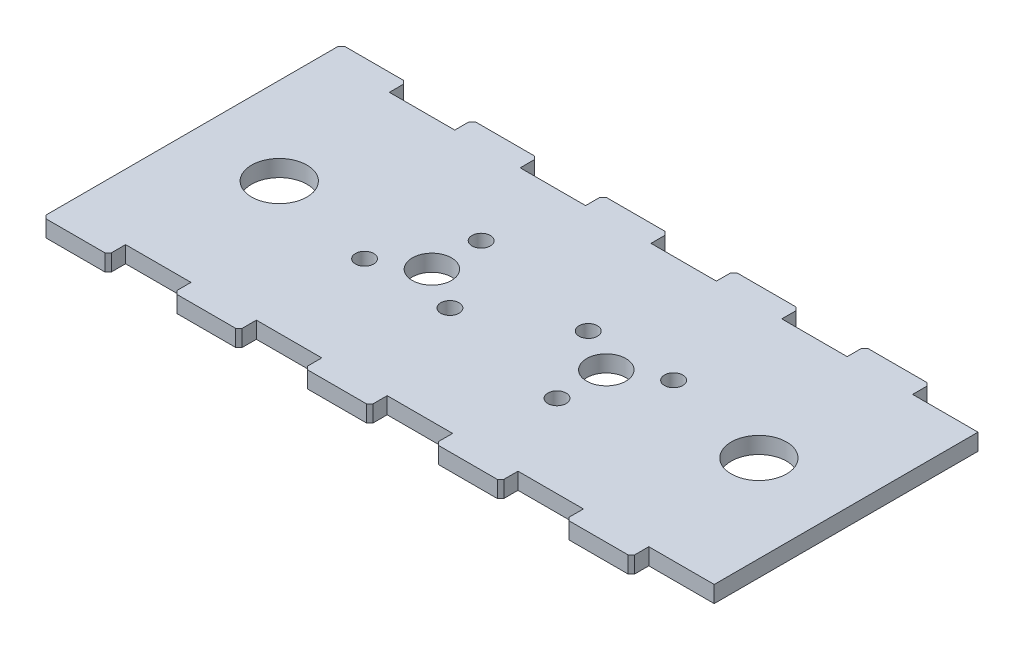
from build123d import *

# Parameters (mm, degrees)
PANEL_W             = 150
PANEL_H             = 60.5
PANEL_R             = 4.5
PANEL_R_2           = 2.1
PANEL_R_3           = 6.35
PANELX3_DEPTH       = 3.81
SKETCH3_W           = 15
SKETCH3_H           = 4
BOSS_EXTRUDE4_DEPTH = 3.81
CHAMFER1_SIZE       = 0.75


with BuildPart() as part:
    # panel → panelx3 (new body)
    with BuildSketch(Plane(origin=(0, 0, 0), x_dir=(1, 0, 0), z_dir=(0, 1, 0))):
        with Locations((75, 30.25)):
            Rectangle(PANEL_W, PANEL_H)
        with Locations(Location((55, 30.25, 0), (0, 0, 270))):
            Circle(PANEL_R, mode=Mode.SUBTRACT)
        with Locations(Location((55, 41.55, 0), (0, 0, 270))):
            Circle(PANEL_R_2, mode=Mode.SUBTRACT)
        with Locations(Location((64.786087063, 24.6, 0), (0, 0, 270))):
            Circle(PANEL_R_2, mode=Mode.SUBTRACT)
        with Locations(Location((45.213912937, 24.6, 0), (0, 0, 270))):
            Circle(PANEL_R_2, mode=Mode.SUBTRACT)
        with Locations(Location((95, 30.25, 0), (0, 0, 270))):
            Circle(PANEL_R, mode=Mode.SUBTRACT)
        with Locations(Location((95, 18.95, 0), (0, 0, 270))):
            Circle(PANEL_R_2, mode=Mode.SUBTRACT)
        with Locations(Location((85.213912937, 35.9, 0), (0, 0, 270))):
            Circle(PANEL_R_2, mode=Mode.SUBTRACT)
        with Locations(Location((104.786087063, 35.9, 0), (0, 0, 270))):
            Circle(PANEL_R_2, mode=Mode.SUBTRACT)
        with Locations(Location((20, 30.25, 0), (0, 0, 270))):
            Circle(PANEL_R_3, mode=Mode.SUBTRACT)
        with Locations(Location((130, 30.25, 0), (0, 0, 270))):
            Circle(PANEL_R_3, mode=Mode.SUBTRACT)
    extrude(amount=PANELX3_DEPTH)

    # Sketch3 → Boss-Extrude4 (add)
    with BuildSketch(Plane(origin=(0, 3.81, 0), x_dir=(1, 0, 0), z_dir=(0, 1, 0))):
        with Locations((7.5, 62.5)):
            Rectangle(SKETCH3_W, SKETCH3_H)
        with Locations((7.5, -2)):
            Rectangle(SKETCH3_W, SKETCH3_H)
        with Locations((37.5, 62.5)):
            Rectangle(SKETCH3_W, SKETCH3_H)
        with Locations((37.5, -2)):
            Rectangle(SKETCH3_W, SKETCH3_H)
        with Locations((67.5, 62.5)):
            Rectangle(SKETCH3_W, SKETCH3_H)
        with Locations((67.5, -2)):
            Rectangle(SKETCH3_W, SKETCH3_H)
        with Locations((97.5, 62.5)):
            Rectangle(SKETCH3_W, SKETCH3_H)
        with Locations((97.5, -2)):
            Rectangle(SKETCH3_W, SKETCH3_H)
        with Locations((127.5, 62.5)):
            Rectangle(SKETCH3_W, SKETCH3_H)
        with Locations((127.5, -2)):
            Rectangle(SKETCH3_W, SKETCH3_H)
    extrude(amount=-BOSS_EXTRUDE4_DEPTH)

    # Chamfer1
    chamfer1_edges = [part.edges().sort_by_distance(p)[0] for p in [
        (60, 1.905, 4),
        (75, 1.905, 4),
        (105, 1.905, -64.5),
        (90, 1.905, -64.5),
        (90, 1.905, 4),
        (105, 1.905, 4),
        (135, 1.905, -64.5),
        (120, 1.905, -64.5),
        (120, 1.905, 4),
        (135, 1.905, 4),
        (15, 1.905, -64.5),
        (0, 1.905, -64.5),
        (0, 1.905, 4),
        (15, 1.905, 4),
        (45, 1.905, -64.5),
        (30, 1.905, -64.5),
        (30, 1.905, 4),
        (45, 1.905, 4),
        (75, 1.905, -64.5),
        (60, 1.905, -64.5),
    ]]
    chamfer(chamfer1_edges, length=CHAMFER1_SIZE)


solid = part.part
